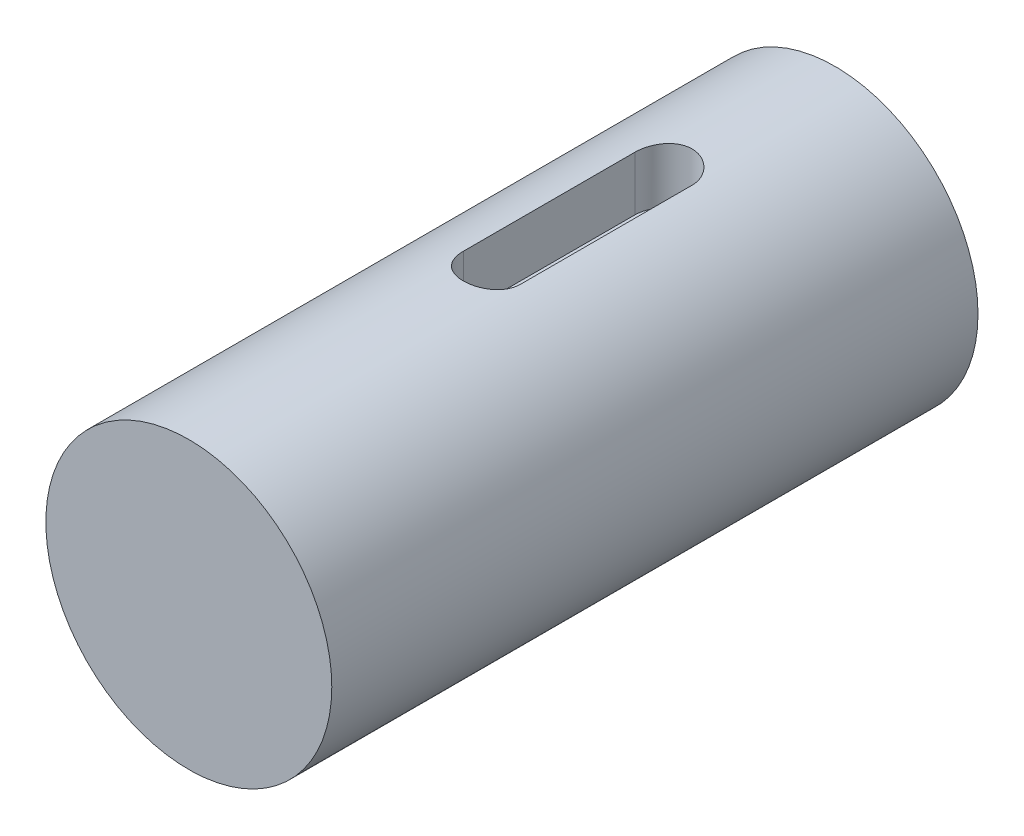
from build123d import *

# Parameters (mm, degrees)
SKIZZE1_R                       = 12.5
LINEAR_AUSTRAGEN1_DEPTH         = 56.5
SCHNITT_LINEAR_AUSTRAGEN1_DEPTH = 5


with BuildPart() as part:
    # Skizze1 → Linear austragen1 (new body)
    with BuildSketch(Plane.XY):
        Circle(SKIZZE1_R)
    extrude(amount=LINEAR_AUSTRAGEN1_DEPTH)

    # Skizze2 → Schnitt-Linear austragen1 (cut)
    with BuildSketch(Plane(origin=(0, 12.5, 0), x_dir=(-1, 0, 0), z_dir=(0, 1, 0))):
        with BuildLine():
            Line((2.5, 30), (2.5, 15))
            ThreePointArc((2.5, 15), (0, 12.5), (-2.5, 15))
            Line((-2.5, 15), (-2.5, 30))
            ThreePointArc((-2.5, 30), (0, 32.5), (2.5, 30))
        make_face()
    extrude(amount=-SCHNITT_LINEAR_AUSTRAGEN1_DEPTH, mode=Mode.SUBTRACT)


solid = part.part
